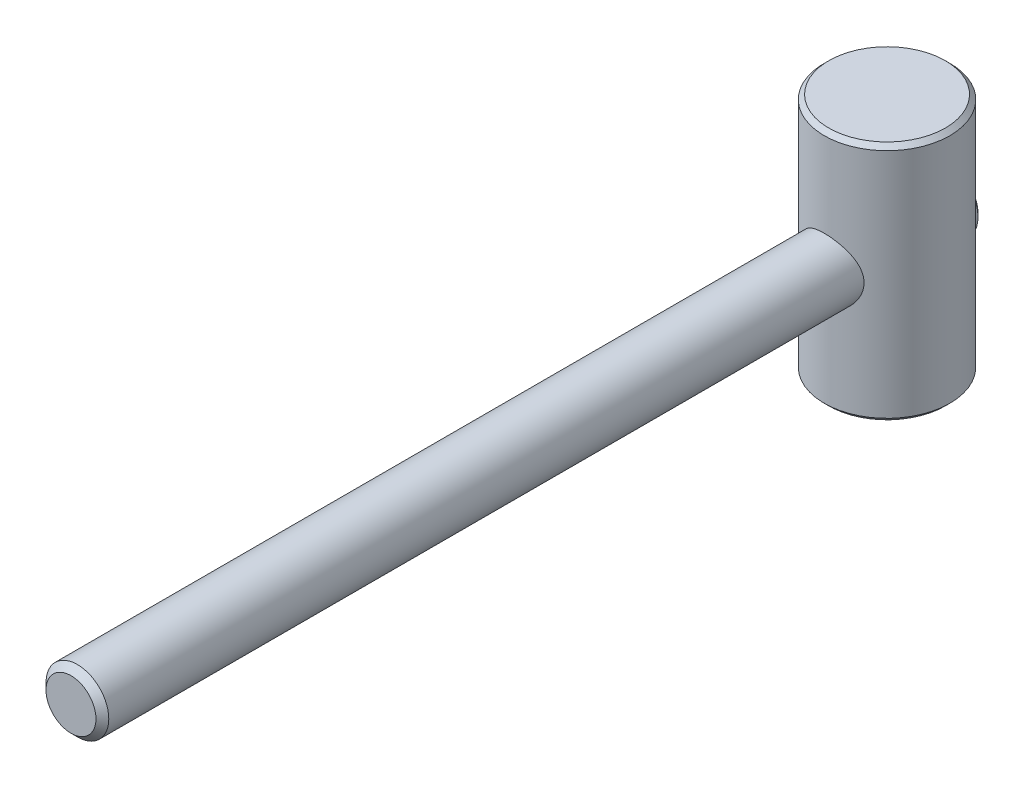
ISO-10303-21;
HEADER;
FILE_DESCRIPTION(('STEP AP214'),'2;1');
FILE_NAME('part.step','',(''),(''),'','','');
FILE_SCHEMA(('AUTOMOTIVE_DESIGN { 1 0 10303 214 1 1 1 1 }'));
ENDSEC;
DATA;
#1=APPLICATION_CONTEXT('core data for automotive mechanical design processes');
#2=APPLICATION_PROTOCOL_DEFINITION('international standard','automotive_design',2000,#1);
#3=PRODUCT_CONTEXT('',#1,'mechanical');
#4=PRODUCT('Part','Part','',(#3));
#5=PRODUCT_RELATED_PRODUCT_CATEGORY('part','',(#4));
#6=PRODUCT_DEFINITION_FORMATION('','',#4);
#7=PRODUCT_DEFINITION_CONTEXT('part definition',#1,'design');
#8=PRODUCT_DEFINITION('design','',#6,#7);
#9=PRODUCT_DEFINITION_SHAPE('','',#8);
#10=(LENGTH_UNIT() NAMED_UNIT(*) SI_UNIT(.MILLI.,.METRE.));
#11=(NAMED_UNIT(*) PLANE_ANGLE_UNIT() SI_UNIT($,.RADIAN.));
#12=(NAMED_UNIT(*) SI_UNIT($,.STERADIAN.) SOLID_ANGLE_UNIT());
#13=UNCERTAINTY_MEASURE_WITH_UNIT(LENGTH_MEASURE(1.E-05),#10,'distance_accuracy_value','');
#14=(GEOMETRIC_REPRESENTATION_CONTEXT(3) GLOBAL_UNCERTAINTY_ASSIGNED_CONTEXT((#13)) GLOBAL_UNIT_ASSIGNED_CONTEXT((#10,
#11,#12)) REPRESENTATION_CONTEXT('',''));
#15=CARTESIAN_POINT('',(0.,0.,0.));
#16=DIRECTION('',(0.,0.,1.));
#17=DIRECTION('',(1.,0.,0.));
#18=AXIS2_PLACEMENT_3D('',#15,#16,#17);
#19=CARTESIAN_POINT('',(0.,0.,-5.));
#20=DIRECTION('',(0.,0.,1.));
#21=DIRECTION('',(1.,0.,0.));
#22=AXIS2_PLACEMENT_3D('',#19,#20,#21);
#23=CYLINDRICAL_SURFACE('',#22,1.5);
#24=CARTESIAN_POINT('',(-0.947331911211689,1.16299709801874,-11.8465));
#25=CARTESIAN_POINT('',(-1.01351143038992,1.10908406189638,-11.8245053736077));
#26=CARTESIAN_POINT('',(-1.07489527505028,1.04969000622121,-11.801479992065));
#27=CARTESIAN_POINT('',(-1.18710041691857,0.920938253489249,-11.7558012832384));
#28=CARTESIAN_POINT('',(-1.2378650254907,0.851530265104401,-11.7331505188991));
#29=CARTESIAN_POINT('',(-1.32722551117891,0.704204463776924,-11.6908987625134));
#30=CARTESIAN_POINT('',(-1.36579908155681,0.626271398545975,-11.6713033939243));
#31=CARTESIAN_POINT('',(-1.42909401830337,0.46394540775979,-11.6379877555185));
#32=CARTESIAN_POINT('',(-1.45385048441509,0.379569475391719,-11.6242526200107));
#33=CARTESIAN_POINT('',(-1.48697739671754,0.213368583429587,-11.6056166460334));
#34=CARTESIAN_POINT('',(-1.49644089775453,0.131829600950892,-11.6001287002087));
#35=CARTESIAN_POINT('',(-1.5018928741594,-0.0318566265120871,-11.5969853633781));
#36=CARTESIAN_POINT('',(-1.49788424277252,-0.114003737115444,-11.5993282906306));
#37=CARTESIAN_POINT('',(-1.47773438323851,-0.267779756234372,-11.6108251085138));
#38=CARTESIAN_POINT('',(-1.4628558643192,-0.339634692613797,-11.6192692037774));
#39=CARTESIAN_POINT('',(-1.42308110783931,-0.479735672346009,-11.6410889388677));
#40=CARTESIAN_POINT('',(-1.39818007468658,-0.547979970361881,-11.6544669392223));
#41=CARTESIAN_POINT('',(-1.33746138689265,-0.683395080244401,-11.6855957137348));
#42=CARTESIAN_POINT('',(-1.30108662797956,-0.750265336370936,-11.7035578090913));
#43=CARTESIAN_POINT('',(-1.21901847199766,-0.877331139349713,-11.7415381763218));
#44=CARTESIAN_POINT('',(-1.17332890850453,-0.93752941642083,-11.7615556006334));
#45=CARTESIAN_POINT('',(-1.09644538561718,-1.02443697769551,-11.7926076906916));
#46=CARTESIAN_POINT('',(-1.06820925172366,-1.05384666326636,-11.8035531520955));
#47=CARTESIAN_POINT('',(-1.00945808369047,-1.11024632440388,-11.825238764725));
#48=CARTESIAN_POINT('',(-0.978947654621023,-1.13724095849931,-11.8359792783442));
#49=CARTESIAN_POINT('',(-0.947331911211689,-1.16299709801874,-11.8465));
#50=B_SPLINE_CURVE_WITH_KNOTS('',3,(#24,#25,#26,#27,#28,#29,#30,#31,#32,#33,#34,#35,#36,#37,#38,
#39,#40,#41,#42,#43,#44,#45,#46,#47,#48,#49),.UNSPECIFIED.,.F.,.F.,(4,2,2,2,2,2,2,2,2,2,2,2,4),
(0.,0.264174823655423,0.52972579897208,0.795759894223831,1.06111506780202,1.30649824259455,
1.55182872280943,1.77244859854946,1.99317416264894,2.22691434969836,2.46055853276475,
2.58708455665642,2.71336100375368),.UNSPECIFIED.);
#51=CARTESIAN_POINT('',(-0.947331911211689,1.16299709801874,-11.8465));
#52=VERTEX_POINT('',#51);
#53=CARTESIAN_POINT('',(-0.947331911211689,-1.16299709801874,-11.8465));
#54=VERTEX_POINT('',#53);
#55=EDGE_CURVE('E271',#52,#54,#50,.T.);
#56=ORIENTED_EDGE('',*,*,#55,.F.);
#57=CARTESIAN_POINT('',(0.,0.,-11.8465));
#58=DIRECTION('',(0.,0.,1.));
#59=DIRECTION('',(1.,0.,0.));
#60=AXIS2_PLACEMENT_3D('',#57,#58,#59);
#61=CIRCLE('',#60,1.5);
#62=EDGE_CURVE('E308',#52,#54,#61,.T.);
#63=ORIENTED_EDGE('',*,*,#62,.T.);
#64=EDGE_LOOP('',(#56,#63));
#65=FACE_BOUND('',#64,.T.);
#66=ADVANCED_FACE('F14',(#65),#23,.T.);
#67=CARTESIAN_POINT('',(0.,0.,-12.));
#68=DIRECTION('',(0.,0.,1.));
#69=DIRECTION('',(1.,0.,0.));
#70=AXIS2_PLACEMENT_3D('',#67,#68,#69);
#71=PLANE('',#70);
#72=DIRECTION('',(0.,-1.,0.));
#73=VECTOR('',#72,1.);
#74=CARTESIAN_POINT('',(0.3,0.,-12.));
#75=LINE('',#74,#73);
#76=CARTESIAN_POINT('',(0.3,1.31265465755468,-12.));
#77=VERTEX_POINT('',#76);
#78=CARTESIAN_POINT('',(0.3,-1.31265465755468,-12.));
#79=VERTEX_POINT('',#78);
#80=EDGE_CURVE('E36',#77,#79,#75,.T.);
#81=ORIENTED_EDGE('',*,*,#80,.F.);
#82=CARTESIAN_POINT('',(0.,0.,-12.));
#83=DIRECTION('',(0.,0.,1.));
#84=DIRECTION('',(1.,0.,0.));
#85=AXIS2_PLACEMENT_3D('',#82,#83,#84);
#86=CIRCLE('',#85,1.3465);
#87=EDGE_CURVE('E305',#79,#77,#86,.T.);
#88=ORIENTED_EDGE('',*,*,#87,.F.);
#89=EDGE_LOOP('',(#81,#88));
#90=FACE_BOUND('',#89,.T.);
#91=ADVANCED_FACE('F231',(#90),#71,.F.);
#92=CARTESIAN_POINT('',(0.,0.,-12.));
#93=DIRECTION('',(0.,0.,1.));
#94=DIRECTION('',(1.,0.,0.));
#95=AXIS2_PLACEMENT_3D('',#92,#93,#94);
#96=CONICAL_SURFACE('',#95,1.3465,0.785398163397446);
#97=CARTESIAN_POINT('',(0.992835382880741,1.14506318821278,-11.83095));
#98=CARTESIAN_POINT('',(0.929590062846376,1.17057691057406,-11.8531359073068));
#99=CARTESIAN_POINT('',(0.864893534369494,1.19430901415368,-11.8734384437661));
#100=CARTESIAN_POINT('',(0.733580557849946,1.23716783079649,-11.9097164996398));
#101=CARTESIAN_POINT('',(0.666989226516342,1.25633751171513,-11.9257325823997));
#102=CARTESIAN_POINT('',(0.531496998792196,1.28959120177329,-11.9533515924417));
#103=CARTESIAN_POINT('',(0.462592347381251,1.30366645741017,-11.9649469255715));
#104=CARTESIAN_POINT('',(0.322550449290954,1.32622709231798,-11.9834605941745));
#105=CARTESIAN_POINT('',(0.251397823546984,1.33465555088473,-11.9903313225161));
#106=CARTESIAN_POINT('',(0.1798,1.33988292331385,-11.994607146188));
#107=B_SPLINE_CURVE_WITH_KNOTS('',3,(#97,#98,#99,#100,#101,#102,#103,#104,#105,#106),
.UNSPECIFIED.,.F.,.F.,(4,2,2,2,4),(0.,0.215180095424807,0.428245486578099,0.641675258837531,
0.857225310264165),.UNSPECIFIED.);
#108=CARTESIAN_POINT('',(0.947331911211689,1.16299709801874,-11.8465));
#109=VERTEX_POINT('',#108);
#110=CARTESIAN_POINT('',(0.674247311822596,1.25340780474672,-11.92325));
#111=VERTEX_POINT('',#110);
#112=EDGE_CURVE('E108',#109,#111,#107,.T.);
#113=ORIENTED_EDGE('',*,*,#112,.F.);
#114=CARTESIAN_POINT('',(0.947331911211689,-1.16299709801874,-11.8465));
#115=VERTEX_POINT('',#114);
#116=EDGE_CURVE('E309',#115,#109,#61,.T.);
#117=ORIENTED_EDGE('',*,*,#116,.F.);
#118=CARTESIAN_POINT('',(0.1798,-1.33988292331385,-11.994607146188));
#119=CARTESIAN_POINT('',(0.236038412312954,-1.335761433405,-11.9912402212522));
#120=CARTESIAN_POINT('',(0.292017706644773,-1.3296804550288,-11.9862800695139));
#121=CARTESIAN_POINT('',(0.40306300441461,-1.31386344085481,-11.9733225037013));
#122=CARTESIAN_POINT('',(0.458129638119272,-1.30413004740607,-11.9653272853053));
#123=CARTESIAN_POINT('',(0.566267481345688,-1.28142693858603,-11.9465768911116));
#124=CARTESIAN_POINT('',(0.619355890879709,-1.26850488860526,-11.9358623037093));
#125=CARTESIAN_POINT('',(0.724099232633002,-1.23969917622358,-11.9117977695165));
#126=CARTESIAN_POINT('',(0.775754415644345,-1.22381603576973,-11.8984482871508));
#127=CARTESIAN_POINT('',(0.854754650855,-1.1971455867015,-11.8758046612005));
#128=CARTESIAN_POINT('',(0.882653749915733,-1.18725045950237,-11.8673620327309));
#129=CARTESIAN_POINT('',(0.938066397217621,-1.16670181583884,-11.8497157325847));
#130=CARTESIAN_POINT('',(0.965577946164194,-1.15604541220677,-11.8405091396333));
#131=CARTESIAN_POINT('',(0.992835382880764,-1.14506318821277,-11.83095));
#132=B_SPLINE_CURVE_WITH_KNOTS('',3,(#118,#119,#120,#121,#122,#123,#124,#125,#126,#127,#128,
#129,#130,#131),.UNSPECIFIED.,.F.,.F.,(4,2,2,2,2,2,4),(0.,0.169384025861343,0.338645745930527,
0.505516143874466,0.672357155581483,0.764685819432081,0.857385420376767),.UNSPECIFIED.);
#133=CARTESIAN_POINT('',(0.674247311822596,-1.25340780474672,-11.92325));
#134=VERTEX_POINT('',#133);
#135=EDGE_CURVE('E114',#134,#115,#132,.T.);
#136=ORIENTED_EDGE('',*,*,#135,.F.);
#137=CARTESIAN_POINT('',(0.,0.,-11.92325));
#138=DIRECTION('',(0.,0.,-1.));
#139=DIRECTION('',(-1.,0.,0.));
#140=AXIS2_PLACEMENT_3D('',#137,#138,#139);
#141=CIRCLE('',#140,1.42325);
#142=CARTESIAN_POINT('',(0.3,-1.39127300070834,-11.92325));
#143=VERTEX_POINT('',#142);
#144=EDGE_CURVE('E194',#134,#143,#141,.T.);
#145=ORIENTED_EDGE('',*,*,#144,.T.);
#146=CARTESIAN_POINT('',(0.3,1.4704082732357,-11.8458));
#147=CARTESIAN_POINT('',(0.3,1.43432199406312,-11.881156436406));
#148=CARTESIAN_POINT('',(0.3,1.39821111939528,-11.9164877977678));
#149=CARTESIAN_POINT('',(0.3,1.32586601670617,-11.9871401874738));
#150=CARTESIAN_POINT('',(0.3,1.28963168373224,-12.0224611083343));
#151=CARTESIAN_POINT('',(0.3,1.21609681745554,-12.0939762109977));
#152=CARTESIAN_POINT('',(0.3,1.17879403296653,-12.1301680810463));
#153=CARTESIAN_POINT('',(0.3,1.10413383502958,-12.2023744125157));
#154=CARTESIAN_POINT('',(0.3,1.06677660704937,-12.2383890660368));
#155=CARTESIAN_POINT('',(0.3,0.959421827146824,-12.3414650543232));
#156=CARTESIAN_POINT('',(0.3,0.88924153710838,-12.4083374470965));
#157=CARTESIAN_POINT('',(0.3,0.782999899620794,-12.5080826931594));
#158=CARTESIAN_POINT('',(0.3,0.7473051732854,-12.5413456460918));
#159=CARTESIAN_POINT('',(0.3,0.67557200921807,-12.6074459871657));
#160=CARTESIAN_POINT('',(0.3,0.639533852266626,-12.6402836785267));
#161=CARTESIAN_POINT('',(0.3,0.567825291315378,-12.7044893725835));
#162=CARTESIAN_POINT('',(0.3,0.532169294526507,-12.7358734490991));
#163=CARTESIAN_POINT('',(0.3,0.459887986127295,-12.7977398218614));
#164=CARTESIAN_POINT('',(0.3,0.423260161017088,-12.8282192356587));
#165=CARTESIAN_POINT('',(0.3,0.367400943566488,-12.8723076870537));
#166=CARTESIAN_POINT('',(0.3,0.348748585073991,-12.8866467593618));
#167=CARTESIAN_POINT('',(0.3,0.310930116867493,-12.9146268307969));
#168=CARTESIAN_POINT('',(0.3,0.291764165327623,-12.9282680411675));
#169=CARTESIAN_POINT('',(0.3,0.252814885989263,-12.9544441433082));
#170=CARTESIAN_POINT('',(0.3,0.233034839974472,-12.9669838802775));
#171=CARTESIAN_POINT('',(0.3,0.192530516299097,-12.990417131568));
#172=CARTESIAN_POINT('',(0.3,0.171808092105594,-13.0013137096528));
#173=CARTESIAN_POINT('',(0.3,0.145940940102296,-13.0129096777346));
#174=CARTESIAN_POINT('',(0.3,0.141366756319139,-13.0148871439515));
#175=CARTESIAN_POINT('',(0.3,0.132159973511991,-13.0187064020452));
#176=CARTESIAN_POINT('',(0.3,0.127527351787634,-13.0205481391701));
#177=CARTESIAN_POINT('',(0.3,0.113544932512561,-13.0258474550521));
#178=CARTESIAN_POINT('',(0.3,0.104108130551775,-13.0290802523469));
#179=CARTESIAN_POINT('',(0.3,0.0851689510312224,-13.0347728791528));
#180=CARTESIAN_POINT('',(0.3,0.0756701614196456,-13.0372444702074));
#181=CARTESIAN_POINT('',(0.3,0.0564948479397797,-13.0413716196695));
#182=CARTESIAN_POINT('',(0.3,0.0468182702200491,-13.0430269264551));
#183=CARTESIAN_POINT('',(0.3,0.0172377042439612,-13.0466422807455));
#184=CARTESIAN_POINT('',(0.3,-0.00287379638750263,-13.047140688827));
#185=CARTESIAN_POINT('',(0.3,-0.0428030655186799,-13.0441231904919));
#186=CARTESIAN_POINT('',(0.3,-0.0626200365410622,-13.0405978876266));
#187=CARTESIAN_POINT('',(0.3,-0.108260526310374,-13.0285808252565));
#188=CARTESIAN_POINT('',(0.3,-0.133719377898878,-13.0187703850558));
#189=CARTESIAN_POINT('',(0.3,-0.17070809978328,-13.0015048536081));
#190=CARTESIAN_POINT('',(0.3,-0.182880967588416,-12.9952966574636));
#191=CARTESIAN_POINT('',(0.3,-0.206871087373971,-12.9822268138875));
#192=CARTESIAN_POINT('',(0.3,-0.218688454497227,-12.9753653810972));
#193=CARTESIAN_POINT('',(0.3,-0.256757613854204,-12.9521887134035));
#194=CARTESIAN_POINT('',(0.3,-0.282394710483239,-12.9348757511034));
#195=CARTESIAN_POINT('',(0.3,-0.332686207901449,-12.8988661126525));
#196=CARTESIAN_POINT('',(0.3,-0.357339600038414,-12.8801680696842));
#197=CARTESIAN_POINT('',(0.3,-0.406041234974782,-12.8418786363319));
#198=CARTESIAN_POINT('',(0.3,-0.43008777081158,-12.8222850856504));
#199=CARTESIAN_POINT('',(0.3,-0.477720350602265,-12.7825441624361));
#200=CARTESIAN_POINT('',(0.3,-0.501306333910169,-12.762396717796));
#201=CARTESIAN_POINT('',(0.3,-0.571740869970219,-12.7012598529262));
#202=CARTESIAN_POINT('',(0.3,-0.618101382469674,-12.6597098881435));
#203=CARTESIAN_POINT('',(0.3,-0.710039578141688,-12.5759094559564));
#204=CARTESIAN_POINT('',(0.3,-0.755618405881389,-12.5336602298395));
#205=CARTESIAN_POINT('',(0.3,-0.857897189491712,-12.4378825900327));
#206=CARTESIAN_POINT('',(0.3,-0.914473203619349,-12.3842219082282));
#207=CARTESIAN_POINT('',(0.3,-1.02726219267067,-12.2764551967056));
#208=CARTESIAN_POINT('',(0.3,-1.08347493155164,-12.2223489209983));
#209=CARTESIAN_POINT('',(0.3,-1.19491746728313,-12.1145797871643));
#210=CARTESIAN_POINT('',(0.3,-1.25015053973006,-12.0609203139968));
#211=CARTESIAN_POINT('',(0.3,-1.36040840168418,-11.9534572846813));
#212=CARTESIAN_POINT('',(0.3,-1.41543330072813,-11.8996538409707));
#213=CARTESIAN_POINT('',(0.3,-1.4704082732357,-11.8458));
#214=B_SPLINE_CURVE_WITH_KNOTS('',3,(#146,#147,#148,#149,#150,#151,#152,#153,#154,#155,#156,
#157,#158,#159,#160,#161,#162,#163,#164,#165,#166,#167,#168,#169,#170,#171,#172,#173,#174,#175,
#176,#177,#178,#179,#180,#181,#182,#183,#184,#185,#186,#187,#188,#189,#190,#191,#192,#193,#194,
#195,#196,#197,#198,#199,#200,#201,#202,#203,#204,#205,#206,#207,#208,#209,#210,#211,#212,#213),
.UNSPECIFIED.,.F.,.F.,(4,2,2,2,2,2,2,2,2,2,2,2,2,2,2,2,2,2,2,2,2,2,2,2,2,2,2,2,2,2,2,2,2,4),(0.,
0.151560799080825,0.303364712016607,0.459287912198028,0.614959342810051,0.905769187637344,
1.05213984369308,1.1983996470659,1.34089509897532,1.48380422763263,1.55437528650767,
1.62492485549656,1.69514667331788,1.76523589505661,1.78018397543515,1.79513805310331,
1.82503814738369,1.85444992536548,1.88387076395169,1.94377833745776,2.00382609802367,
2.08518752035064,2.12617578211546,2.16715062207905,2.25986253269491,2.35266718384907,
2.44570893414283,2.53876285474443,2.72550711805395,2.91194943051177,3.14587396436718,
3.37993768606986,3.6109572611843,3.84183089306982),.UNSPECIFIED.);
#215=EDGE_CURVE('E227',#79,#143,#214,.T.);
#216=ORIENTED_EDGE('',*,*,#215,.F.);
#217=ORIENTED_EDGE('',*,*,#87,.T.);
#218=CARTESIAN_POINT('',(0.3,1.39127300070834,-11.92325));
#219=VERTEX_POINT('',#218);
#220=EDGE_CURVE('E32',#219,#77,#214,.T.);
#221=ORIENTED_EDGE('',*,*,#220,.F.);
#222=CARTESIAN_POINT('',(0.,0.,-11.92325));
#223=DIRECTION('',(0.,0.,-1.));
#224=DIRECTION('',(-1.,0.,0.));
#225=AXIS2_PLACEMENT_3D('',#222,#223,#224);
#226=CIRCLE('',#225,1.42325);
#227=EDGE_CURVE('E104',#219,#111,#226,.T.);
#228=ORIENTED_EDGE('',*,*,#227,.T.);
#229=EDGE_LOOP('',(#113,#117,#136,#145,#216,#217,#221,#228));
#230=FACE_BOUND('',#229,.T.);
#231=ADVANCED_FACE('F106',(#230),#96,.T.);
#232=CARTESIAN_POINT('',(-0.3,0.,-42.3));
#233=DIRECTION('',(1.,0.,0.));
#234=DIRECTION('',(0.,-1.,0.));
#235=AXIS2_PLACEMENT_3D('',#232,#233,#234);
#236=CYLINDRICAL_SURFACE('',#235,31.5);
#237=CARTESIAN_POINT('',(-0.3,-1.33111241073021,-10.8281373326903));
#238=CARTESIAN_POINT('',(-0.262266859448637,-1.33962103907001,-10.8284977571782));
#239=CARTESIAN_POINT('',(-0.224170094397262,-1.34651682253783,-10.828792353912));
#240=CARTESIAN_POINT('',(-0.14752354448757,-1.35705208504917,-10.8292445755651));
#241=CARTESIAN_POINT('',(-0.108973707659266,-1.36069118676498,-10.8294021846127));
#242=CARTESIAN_POINT('',(-0.0324105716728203,-1.36464401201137,-10.8295734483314));
#243=CARTESIAN_POINT('',(0.00559964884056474,-1.3650173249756,-10.8295896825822));
#244=CARTESIAN_POINT('',(0.0815076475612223,-1.36259212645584,-10.8294844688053));
#245=CARTESIAN_POINT('',(0.119405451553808,-1.35979440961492,-10.8293630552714));
#246=CARTESIAN_POINT('',(0.205128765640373,-1.34986012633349,-10.8289356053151));
#247=CARTESIAN_POINT('',(0.252842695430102,-1.34174825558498,-10.8285882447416));
#248=CARTESIAN_POINT('',(0.3,-1.33111241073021,-10.8281373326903));
#249=B_SPLINE_CURVE_WITH_KNOTS('',3,(#237,#238,#239,#240,#241,#242,#243,#244,#245,#246,#247,
#248),.UNSPECIFIED.,.F.,.F.,(4,2,2,2,2,4),(0.,0.116010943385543,0.232035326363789,
0.345938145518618,0.459812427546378,0.604746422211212),.UNSPECIFIED.);
#250=CARTESIAN_POINT('',(-0.3,-1.33111241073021,-10.8281373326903));
#251=VERTEX_POINT('',#250);
#252=CARTESIAN_POINT('',(0.3,-1.33111241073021,-10.8281373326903));
#253=VERTEX_POINT('',#252);
#254=EDGE_CURVE('E199',#251,#253,#249,.T.);
#255=ORIENTED_EDGE('',*,*,#254,.F.);
#256=CARTESIAN_POINT('',(-0.3,0.,-42.3));
#257=DIRECTION('',(-1.,0.,0.));
#258=DIRECTION('',(0.,1.,0.));
#259=AXIS2_PLACEMENT_3D('',#256,#257,#258);
#260=CIRCLE('',#259,31.5);
#261=CARTESIAN_POINT('',(-0.3,1.33111241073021,-10.8281373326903));
#262=VERTEX_POINT('',#261);
#263=EDGE_CURVE('E19',#251,#262,#260,.T.);
#264=ORIENTED_EDGE('',*,*,#263,.T.);
#265=CARTESIAN_POINT('',(0.3,1.33111241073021,-10.8281373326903));
#266=CARTESIAN_POINT('',(0.262266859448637,1.33962103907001,-10.8284977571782));
#267=CARTESIAN_POINT('',(0.224170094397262,1.34651682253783,-10.828792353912));
#268=CARTESIAN_POINT('',(0.14752354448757,1.35705208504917,-10.8292445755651));
#269=CARTESIAN_POINT('',(0.108973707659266,1.36069118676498,-10.8294021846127));
#270=CARTESIAN_POINT('',(0.0324105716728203,1.36464401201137,-10.8295734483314));
#271=CARTESIAN_POINT('',(-0.00559964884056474,1.3650173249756,-10.8295896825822));
#272=CARTESIAN_POINT('',(-0.0815076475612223,1.36259212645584,-10.8294844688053));
#273=CARTESIAN_POINT('',(-0.119405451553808,1.35979440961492,-10.8293630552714));
#274=CARTESIAN_POINT('',(-0.205128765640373,1.34986012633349,-10.8289356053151));
#275=CARTESIAN_POINT('',(-0.252842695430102,1.34174825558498,-10.8285882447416));
#276=CARTESIAN_POINT('',(-0.3,1.33111241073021,-10.8281373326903));
#277=B_SPLINE_CURVE_WITH_KNOTS('',3,(#265,#266,#267,#268,#269,#270,#271,#272,#273,#274,#275,
#276),.UNSPECIFIED.,.F.,.F.,(4,2,2,2,2,4),(0.,0.116010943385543,0.232035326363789,
0.345938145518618,0.459812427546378,0.604746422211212),.UNSPECIFIED.);
#278=CARTESIAN_POINT('',(0.3,1.33111241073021,-10.8281373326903));
#279=VERTEX_POINT('',#278);
#280=EDGE_CURVE('E143',#279,#262,#277,.T.);
#281=ORIENTED_EDGE('',*,*,#280,.F.);
#282=CARTESIAN_POINT('',(0.3,0.,-42.3));
#283=DIRECTION('',(-1.,0.,0.));
#284=DIRECTION('',(0.,1.,0.));
#285=AXIS2_PLACEMENT_3D('',#282,#283,#284);
#286=CIRCLE('',#285,31.5);
#287=EDGE_CURVE('E130',#253,#279,#286,.T.);
#288=ORIENTED_EDGE('',*,*,#287,.F.);
#289=EDGE_LOOP('',(#255,#264,#281,#288));
#290=FACE_BOUND('',#289,.T.);
#291=ADVANCED_FACE('F206',(#290),#236,.F.);
#292=CARTESIAN_POINT('',(0.3,0.,-42.3));
#293=DIRECTION('',(-1.,0.,0.));
#294=DIRECTION('',(0.,1.,0.));
#295=AXIS2_PLACEMENT_3D('',#292,#293,#294);
#296=PLANE('',#295);
#297=CARTESIAN_POINT('',(0.3,-0.671318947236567,-11.2353020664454));
#298=CARTESIAN_POINT('',(0.3,-0.697833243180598,-11.2595157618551));
#299=CARTESIAN_POINT('',(0.3,-0.724235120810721,-11.283851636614));
#300=CARTESIAN_POINT('',(0.3,-0.776860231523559,-11.3327148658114));
#301=CARTESIAN_POINT('',(0.3,-0.803083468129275,-11.3572422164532));
#302=CARTESIAN_POINT('',(0.3,-0.881553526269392,-11.4310312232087));
#303=CARTESIAN_POINT('',(0.3,-0.933603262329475,-11.4805021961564));
#304=CARTESIAN_POINT('',(0.3,-1.03737516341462,-11.5797783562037));
#305=CARTESIAN_POINT('',(0.3,-1.08909735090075,-11.6295835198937));
#306=CARTESIAN_POINT('',(0.3,-1.19232568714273,-11.7294186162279));
#307=CARTESIAN_POINT('',(0.3,-1.24383183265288,-11.7794485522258));
#308=CARTESIAN_POINT('',(0.3,-1.41719880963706,-11.9483370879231));
#309=CARTESIAN_POINT('',(0.3,-1.53872304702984,-12.0675409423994));
#310=CARTESIAN_POINT('',(0.3,-1.72072148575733,-12.2466471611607));
#311=CARTESIAN_POINT('',(0.3,-1.78134186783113,-12.3064015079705));
#312=CARTESIAN_POINT('',(0.3,-1.9025053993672,-12.4259878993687));
#313=CARTESIAN_POINT('',(0.3,-1.96304854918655,-12.4858199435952));
#314=CARTESIAN_POINT('',(0.3,-2.02356348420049,-12.545680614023));
#315=B_SPLINE_CURVE_WITH_KNOTS('',3,(#297,#298,#299,#300,#301,#302,#303,#304,#305,#306,#307,
#308,#309,#310,#311,#312,#313,#314),.UNSPECIFIED.,.F.,.F.,(4,2,2,2,2,2,2,2,4),(0.,
0.107719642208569,0.215437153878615,0.430861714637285,0.646271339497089,0.861684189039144,
1.37236666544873,1.62772666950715,1.88308548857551),.UNSPECIFIED.);
#316=CARTESIAN_POINT('',(0.3,-1.33111241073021,-11.8645));
#317=VERTEX_POINT('',#316);
#318=EDGE_CURVE('E178',#317,#143,#315,.T.);
#319=ORIENTED_EDGE('',*,*,#318,.F.);
#320=DIRECTION('',(0.,0.,1.));
#321=VECTOR('',#320,1.);
#322=CARTESIAN_POINT('',(0.3,-1.33111241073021,-6.));
#323=LINE('',#322,#321);
#324=EDGE_CURVE('E292',#253,#317,#323,.F.);
#325=ORIENTED_EDGE('',*,*,#324,.F.);
#326=ORIENTED_EDGE('',*,*,#287,.T.);
#327=DIRECTION('',(0.,0.,1.));
#328=VECTOR('',#327,1.);
#329=CARTESIAN_POINT('',(0.3,1.33111241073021,-6.));
#330=LINE('',#329,#328);
#331=CARTESIAN_POINT('',(0.3,1.33111241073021,-11.8645));
#332=VERTEX_POINT('',#331);
#333=EDGE_CURVE('E299',#332,#279,#330,.T.);
#334=ORIENTED_EDGE('',*,*,#333,.F.);
#335=CARTESIAN_POINT('',(0.3,2.02134819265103,-12.5434892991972));
#336=CARTESIAN_POINT('',(0.3,1.96583089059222,-12.4885737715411));
#337=CARTESIAN_POINT('',(0.3,1.91028984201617,-12.4336823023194));
#338=CARTESIAN_POINT('',(0.3,1.79914422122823,-12.3239633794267));
#339=CARTESIAN_POINT('',(0.3,1.74353964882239,-12.2691359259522));
#340=CARTESIAN_POINT('',(0.3,1.57661382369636,-12.1047805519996));
#341=CARTESIAN_POINT('',(0.3,1.46517376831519,-11.9953729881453));
#342=CARTESIAN_POINT('',(0.3,1.29755058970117,-11.8317264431));
#343=CARTESIAN_POINT('',(0.3,1.24159669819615,-11.7772528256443));
#344=CARTESIAN_POINT('',(0.3,1.12946087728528,-11.668542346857));
#345=CARTESIAN_POINT('',(0.3,1.07327895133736,-11.614305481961));
#346=CARTESIAN_POINT('',(0.3,0.960561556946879,-11.5061914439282));
#347=CARTESIAN_POINT('',(0.3,0.904026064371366,-11.4523142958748));
#348=CARTESIAN_POINT('',(0.3,0.81878330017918,-11.3719612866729));
#349=CARTESIAN_POINT('',(0.3,0.790295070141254,-11.3452534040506));
#350=CARTESIAN_POINT('',(0.3,0.733115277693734,-11.2920550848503));
#351=CARTESIAN_POINT('',(0.3,0.704423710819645,-11.2655646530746));
#352=CARTESIAN_POINT('',(0.3,0.675602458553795,-11.2392149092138));
#353=B_SPLINE_CURVE_WITH_KNOTS('',3,(#335,#336,#337,#338,#339,#340,#341,#342,#343,#344,#345,
#346,#347,#348,#349,#350,#351,#352),.UNSPECIFIED.,.F.,.F.,(4,2,2,2,2,2,2,2,4),(0.,
0.234266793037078,0.468534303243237,0.937041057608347,1.1713137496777,1.40558290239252,
1.63986822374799,1.75701676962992,1.87416789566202),.UNSPECIFIED.);
#354=EDGE_CURVE('E170',#219,#332,#353,.T.);
#355=ORIENTED_EDGE('',*,*,#354,.F.);
#356=ORIENTED_EDGE('',*,*,#220,.T.);
#357=ORIENTED_EDGE('',*,*,#80,.T.);
#358=ORIENTED_EDGE('',*,*,#215,.T.);
#359=EDGE_LOOP('',(#319,#325,#326,#334,#355,#356,#357,#358));
#360=FACE_BOUND('',#359,.T.);
#361=ADVANCED_FACE('F210',(#360),#296,.T.);
#362=CARTESIAN_POINT('',(-0.3,1.31265465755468,-12.));
#363=VERTEX_POINT('',#362);
#364=CARTESIAN_POINT('',(-0.3,-1.31265465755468,-12.));
#365=VERTEX_POINT('',#364);
#366=EDGE_CURVE('E301',#363,#365,#86,.T.);
#367=ORIENTED_EDGE('',*,*,#366,.F.);
#368=DIRECTION('',(0.,-1.,0.));
#369=VECTOR('',#368,1.);
#370=CARTESIAN_POINT('',(-0.3,0.,-12.));
#371=LINE('',#370,#369);
#372=EDGE_CURVE('E311',#363,#365,#371,.T.);
#373=ORIENTED_EDGE('',*,*,#372,.T.);
#374=EDGE_LOOP('',(#367,#373));
#375=FACE_BOUND('',#374,.T.);
#376=ADVANCED_FACE('F218',(#375),#71,.F.);
#377=CARTESIAN_POINT('',(-0.1798,1.33988292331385,-11.994607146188));
#378=CARTESIAN_POINT('',(-0.236038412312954,1.335761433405,-11.9912402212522));
#379=CARTESIAN_POINT('',(-0.292017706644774,1.3296804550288,-11.9862800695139));
#380=CARTESIAN_POINT('',(-0.403063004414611,1.31386344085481,-11.9733225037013));
#381=CARTESIAN_POINT('',(-0.458129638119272,1.30413004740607,-11.9653272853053));
#382=CARTESIAN_POINT('',(-0.566267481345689,1.28142693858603,-11.9465768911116));
#383=CARTESIAN_POINT('',(-0.61935589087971,1.26850488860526,-11.9358623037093));
#384=CARTESIAN_POINT('',(-0.724099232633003,1.23969917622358,-11.9117977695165));
#385=CARTESIAN_POINT('',(-0.775754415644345,1.22381603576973,-11.8984482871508));
#386=CARTESIAN_POINT('',(-0.854754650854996,1.1971455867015,-11.8758046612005));
#387=CARTESIAN_POINT('',(-0.882653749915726,1.18725045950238,-11.8673620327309));
#388=CARTESIAN_POINT('',(-0.938066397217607,1.16670181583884,-11.8497157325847));
#389=CARTESIAN_POINT('',(-0.965577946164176,1.15604541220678,-11.8405091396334));
#390=CARTESIAN_POINT('',(-0.992835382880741,1.14506318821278,-11.83095));
#391=B_SPLINE_CURVE_WITH_KNOTS('',3,(#377,#378,#379,#380,#381,#382,#383,#384,#385,#386,#387,
#388,#389,#390),.UNSPECIFIED.,.F.,.F.,(4,2,2,2,2,2,4),(0.,0.169384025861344,0.338645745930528,
0.505516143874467,0.672357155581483,0.764685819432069,0.857385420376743),.UNSPECIFIED.);
#392=CARTESIAN_POINT('',(-0.674247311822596,1.25340780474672,-11.92325));
#393=VERTEX_POINT('',#392);
#394=EDGE_CURVE('E250',#393,#52,#391,.T.);
#395=ORIENTED_EDGE('',*,*,#394,.F.);
#396=CARTESIAN_POINT('',(0.,0.,-11.92325));
#397=DIRECTION('',(0.,0.,-1.));
#398=DIRECTION('',(-1.,0.,0.));
#399=AXIS2_PLACEMENT_3D('',#396,#397,#398);
#400=CIRCLE('',#399,1.42325);
#401=CARTESIAN_POINT('',(-0.3,1.39127300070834,-11.92325));
#402=VERTEX_POINT('',#401);
#403=EDGE_CURVE('E128',#393,#402,#400,.T.);
#404=ORIENTED_EDGE('',*,*,#403,.T.);
#405=CARTESIAN_POINT('',(-0.3,1.4704082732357,-11.8458));
#406=CARTESIAN_POINT('',(-0.3,1.43432199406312,-11.881156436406));
#407=CARTESIAN_POINT('',(-0.3,1.39821111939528,-11.9164877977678));
#408=CARTESIAN_POINT('',(-0.3,1.32586601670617,-11.9871401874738));
#409=CARTESIAN_POINT('',(-0.3,1.28963168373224,-12.0224611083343));
#410=CARTESIAN_POINT('',(-0.3,1.21609681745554,-12.0939762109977));
#411=CARTESIAN_POINT('',(-0.3,1.17879403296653,-12.1301680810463));
#412=CARTESIAN_POINT('',(-0.3,1.10413383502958,-12.2023744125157));
#413=CARTESIAN_POINT('',(-0.3,1.06677660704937,-12.2383890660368));
#414=CARTESIAN_POINT('',(-0.3,0.959421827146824,-12.3414650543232));
#415=CARTESIAN_POINT('',(-0.3,0.88924153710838,-12.4083374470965));
#416=CARTESIAN_POINT('',(-0.3,0.782999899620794,-12.5080826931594));
#417=CARTESIAN_POINT('',(-0.3,0.7473051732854,-12.5413456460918));
#418=CARTESIAN_POINT('',(-0.3,0.67557200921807,-12.6074459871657));
#419=CARTESIAN_POINT('',(-0.3,0.639533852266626,-12.6402836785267));
#420=CARTESIAN_POINT('',(-0.3,0.567825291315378,-12.7044893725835));
#421=CARTESIAN_POINT('',(-0.3,0.532169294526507,-12.7358734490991));
#422=CARTESIAN_POINT('',(-0.3,0.459887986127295,-12.7977398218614));
#423=CARTESIAN_POINT('',(-0.3,0.423260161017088,-12.8282192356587));
#424=CARTESIAN_POINT('',(-0.3,0.367400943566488,-12.8723076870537));
#425=CARTESIAN_POINT('',(-0.3,0.348748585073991,-12.8866467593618));
#426=CARTESIAN_POINT('',(-0.3,0.310930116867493,-12.9146268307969));
#427=CARTESIAN_POINT('',(-0.3,0.291764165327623,-12.9282680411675));
#428=CARTESIAN_POINT('',(-0.3,0.252814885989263,-12.9544441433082));
#429=CARTESIAN_POINT('',(-0.3,0.233034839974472,-12.9669838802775));
#430=CARTESIAN_POINT('',(-0.3,0.192530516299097,-12.990417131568));
#431=CARTESIAN_POINT('',(-0.3,0.171808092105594,-13.0013137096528));
#432=CARTESIAN_POINT('',(-0.3,0.145940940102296,-13.0129096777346));
#433=CARTESIAN_POINT('',(-0.3,0.141366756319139,-13.0148871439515));
#434=CARTESIAN_POINT('',(-0.3,0.132159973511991,-13.0187064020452));
#435=CARTESIAN_POINT('',(-0.3,0.127527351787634,-13.0205481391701));
#436=CARTESIAN_POINT('',(-0.3,0.113544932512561,-13.0258474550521));
#437=CARTESIAN_POINT('',(-0.3,0.104108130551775,-13.0290802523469));
#438=CARTESIAN_POINT('',(-0.3,0.0851689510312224,-13.0347728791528));
#439=CARTESIAN_POINT('',(-0.3,0.0756701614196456,-13.0372444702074));
#440=CARTESIAN_POINT('',(-0.3,0.0564948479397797,-13.0413716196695));
#441=CARTESIAN_POINT('',(-0.3,0.0468182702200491,-13.0430269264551));
#442=CARTESIAN_POINT('',(-0.3,0.0172377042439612,-13.0466422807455));
#443=CARTESIAN_POINT('',(-0.3,-0.00287379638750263,-13.047140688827));
#444=CARTESIAN_POINT('',(-0.3,-0.0428030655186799,-13.0441231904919));
#445=CARTESIAN_POINT('',(-0.3,-0.0626200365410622,-13.0405978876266));
#446=CARTESIAN_POINT('',(-0.3,-0.108260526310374,-13.0285808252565));
#447=CARTESIAN_POINT('',(-0.3,-0.133719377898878,-13.0187703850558));
#448=CARTESIAN_POINT('',(-0.3,-0.17070809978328,-13.0015048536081));
#449=CARTESIAN_POINT('',(-0.3,-0.182880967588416,-12.9952966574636));
#450=CARTESIAN_POINT('',(-0.3,-0.206871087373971,-12.9822268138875));
#451=CARTESIAN_POINT('',(-0.3,-0.218688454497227,-12.9753653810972));
#452=CARTESIAN_POINT('',(-0.3,-0.256757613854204,-12.9521887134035));
#453=CARTESIAN_POINT('',(-0.3,-0.282394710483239,-12.9348757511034));
#454=CARTESIAN_POINT('',(-0.3,-0.332686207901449,-12.8988661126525));
#455=CARTESIAN_POINT('',(-0.3,-0.357339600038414,-12.8801680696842));
#456=CARTESIAN_POINT('',(-0.3,-0.406041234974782,-12.8418786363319));
#457=CARTESIAN_POINT('',(-0.3,-0.43008777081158,-12.8222850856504));
#458=CARTESIAN_POINT('',(-0.3,-0.477720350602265,-12.7825441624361));
#459=CARTESIAN_POINT('',(-0.3,-0.501306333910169,-12.762396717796));
#460=CARTESIAN_POINT('',(-0.3,-0.571740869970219,-12.7012598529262));
#461=CARTESIAN_POINT('',(-0.3,-0.618101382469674,-12.6597098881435));
#462=CARTESIAN_POINT('',(-0.3,-0.710039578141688,-12.5759094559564));
#463=CARTESIAN_POINT('',(-0.3,-0.755618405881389,-12.5336602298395));
#464=CARTESIAN_POINT('',(-0.3,-0.857897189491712,-12.4378825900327));
#465=CARTESIAN_POINT('',(-0.3,-0.914473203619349,-12.3842219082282));
#466=CARTESIAN_POINT('',(-0.3,-1.02726219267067,-12.2764551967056));
#467=CARTESIAN_POINT('',(-0.3,-1.08347493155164,-12.2223489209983));
#468=CARTESIAN_POINT('',(-0.3,-1.19491746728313,-12.1145797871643));
#469=CARTESIAN_POINT('',(-0.3,-1.25015053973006,-12.0609203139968));
#470=CARTESIAN_POINT('',(-0.3,-1.36040840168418,-11.9534572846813));
#471=CARTESIAN_POINT('',(-0.3,-1.41543330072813,-11.8996538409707));
#472=CARTESIAN_POINT('',(-0.3,-1.4704082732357,-11.8458));
#473=B_SPLINE_CURVE_WITH_KNOTS('',3,(#405,#406,#407,#408,#409,#410,#411,#412,#413,#414,#415,
#416,#417,#418,#419,#420,#421,#422,#423,#424,#425,#426,#427,#428,#429,#430,#431,#432,#433,#434,
#435,#436,#437,#438,#439,#440,#441,#442,#443,#444,#445,#446,#447,#448,#449,#450,#451,#452,#453,
#454,#455,#456,#457,#458,#459,#460,#461,#462,#463,#464,#465,#466,#467,#468,#469,#470,#471,#472),
.UNSPECIFIED.,.F.,.F.,(4,2,2,2,2,2,2,2,2,2,2,2,2,2,2,2,2,2,2,2,2,2,2,2,2,2,2,2,2,2,2,2,2,4),(0.,
0.151560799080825,0.303364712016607,0.459287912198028,0.614959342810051,0.905769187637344,
1.05213984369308,1.1983996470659,1.34089509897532,1.48380422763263,1.55437528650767,
1.62492485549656,1.69514667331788,1.76523589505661,1.78018397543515,1.79513805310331,
1.82503814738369,1.85444992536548,1.88387076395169,1.94377833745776,2.00382609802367,
2.08518752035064,2.12617578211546,2.16715062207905,2.25986253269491,2.35266718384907,
2.44570893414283,2.53876285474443,2.72550711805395,2.91194943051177,3.14587396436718,
3.37993768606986,3.6109572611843,3.84183089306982),.UNSPECIFIED.);
#474=EDGE_CURVE('E237',#402,#363,#473,.T.);
#475=ORIENTED_EDGE('',*,*,#474,.T.);
#476=ORIENTED_EDGE('',*,*,#366,.T.);
#477=CARTESIAN_POINT('',(-0.3,-1.39127300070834,-11.92325));
#478=VERTEX_POINT('',#477);
#479=EDGE_CURVE('E310',#365,#478,#473,.T.);
#480=ORIENTED_EDGE('',*,*,#479,.T.);
#481=CARTESIAN_POINT('',(0.,0.,-11.92325));
#482=DIRECTION('',(0.,0.,-1.));
#483=DIRECTION('',(-1.,0.,0.));
#484=AXIS2_PLACEMENT_3D('',#481,#482,#483);
#485=CIRCLE('',#484,1.42325);
#486=CARTESIAN_POINT('',(-0.674247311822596,-1.25340780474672,-11.92325));
#487=VERTEX_POINT('',#486);
#488=EDGE_CURVE('E193',#478,#487,#485,.T.);
#489=ORIENTED_EDGE('',*,*,#488,.T.);
#490=CARTESIAN_POINT('',(-0.992835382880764,-1.14506318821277,-11.83095));
#491=CARTESIAN_POINT('',(-0.929590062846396,-1.17057691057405,-11.8531359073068));
#492=CARTESIAN_POINT('',(-0.864893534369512,-1.19430901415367,-11.8734384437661));
#493=CARTESIAN_POINT('',(-0.733580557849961,-1.23716783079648,-11.9097164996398));
#494=CARTESIAN_POINT('',(-0.666989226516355,-1.25633751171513,-11.9257325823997));
#495=CARTESIAN_POINT('',(-0.531496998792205,-1.28959120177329,-11.9533515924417));
#496=CARTESIAN_POINT('',(-0.462592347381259,-1.30366645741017,-11.9649469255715));
#497=CARTESIAN_POINT('',(-0.322550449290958,-1.32622709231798,-11.9834605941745));
#498=CARTESIAN_POINT('',(-0.251397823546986,-1.33465555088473,-11.9903313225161));
#499=CARTESIAN_POINT('',(-0.1798,-1.33988292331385,-11.994607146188));
#500=B_SPLINE_CURVE_WITH_KNOTS('',3,(#490,#491,#492,#493,#494,#495,#496,#497,#498,#499),
.UNSPECIFIED.,.F.,.F.,(4,2,2,2,4),(0.,0.215180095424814,0.42824548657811,0.641675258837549,
0.857225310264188),.UNSPECIFIED.);
#501=EDGE_CURVE('E244',#54,#487,#500,.T.);
#502=ORIENTED_EDGE('',*,*,#501,.F.);
#503=ORIENTED_EDGE('',*,*,#62,.F.);
#504=EDGE_LOOP('',(#395,#404,#475,#476,#480,#489,#502,#503));
#505=FACE_BOUND('',#504,.T.);
#506=ADVANCED_FACE('F232',(#505),#96,.T.);
#507=CARTESIAN_POINT('',(-0.3,0.,-42.3));
#508=DIRECTION('',(-1.,0.,0.));
#509=DIRECTION('',(0.,1.,0.));
#510=AXIS2_PLACEMENT_3D('',#507,#508,#509);
#511=PLANE('',#510);
#512=DIRECTION('',(0.,0.,1.));
#513=VECTOR('',#512,1.);
#514=CARTESIAN_POINT('',(-0.3,-1.33111241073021,-6.));
#515=LINE('',#514,#513);
#516=CARTESIAN_POINT('',(-0.3,-1.33111241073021,-11.8645));
#517=VERTEX_POINT('',#516);
#518=EDGE_CURVE('E192',#251,#517,#515,.F.);
#519=ORIENTED_EDGE('',*,*,#518,.T.);
#520=CARTESIAN_POINT('',(-0.3,-0.671318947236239,-11.2353020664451));
#521=CARTESIAN_POINT('',(-0.3,-0.697833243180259,-11.2595157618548));
#522=CARTESIAN_POINT('',(-0.3,-0.724235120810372,-11.2838516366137));
#523=CARTESIAN_POINT('',(-0.3,-0.77686023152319,-11.3327148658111));
#524=CARTESIAN_POINT('',(-0.3,-0.803083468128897,-11.3572422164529));
#525=CARTESIAN_POINT('',(-0.3,-0.881553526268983,-11.4310312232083));
#526=CARTESIAN_POINT('',(-0.3,-0.933603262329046,-11.480502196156));
#527=CARTESIAN_POINT('',(-0.3,-1.03737516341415,-11.5797783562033));
#528=CARTESIAN_POINT('',(-0.3,-1.08909735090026,-11.6295835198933));
#529=CARTESIAN_POINT('',(-0.3,-1.1923256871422,-11.7294186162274));
#530=CARTESIAN_POINT('',(-0.3,-1.24383183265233,-11.7794485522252));
#531=CARTESIAN_POINT('',(-0.3,-1.41719880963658,-11.9483370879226));
#532=CARTESIAN_POINT('',(-0.3,-1.53872304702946,-12.067540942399));
#533=CARTESIAN_POINT('',(-0.3,-1.72072148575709,-12.2466471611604));
#534=CARTESIAN_POINT('',(-0.3,-1.78134186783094,-12.3064015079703));
#535=CARTESIAN_POINT('',(-0.3,-1.9025053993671,-12.4259878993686));
#536=CARTESIAN_POINT('',(-0.3,-1.9630485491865,-12.4858199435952));
#537=CARTESIAN_POINT('',(-0.3,-2.02356348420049,-12.545680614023));
#538=B_SPLINE_CURVE_WITH_KNOTS('',3,(#520,#521,#522,#523,#524,#525,#526,#527,#528,#529,#530,
#531,#532,#533,#534,#535,#536,#537),.UNSPECIFIED.,.F.,.F.,(4,2,2,2,2,2,2,2,4),(0.,
0.107719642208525,0.215437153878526,0.430861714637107,0.646271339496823,0.86168418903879,
1.37236666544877,1.6277266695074,1.88308548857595),.UNSPECIFIED.);
#539=EDGE_CURVE('E185',#517,#478,#538,.T.);
#540=ORIENTED_EDGE('',*,*,#539,.T.);
#541=ORIENTED_EDGE('',*,*,#479,.F.);
#542=ORIENTED_EDGE('',*,*,#372,.F.);
#543=ORIENTED_EDGE('',*,*,#474,.F.);
#544=CARTESIAN_POINT('',(-0.3,2.02134819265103,-12.5434892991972));
#545=CARTESIAN_POINT('',(-0.3,1.96583089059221,-12.4885737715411));
#546=CARTESIAN_POINT('',(-0.3,1.91028984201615,-12.4336823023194));
#547=CARTESIAN_POINT('',(-0.3,1.79914422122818,-12.3239633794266));
#548=CARTESIAN_POINT('',(-0.3,1.74353964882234,-12.2691359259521));
#549=CARTESIAN_POINT('',(-0.3,1.57661382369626,-12.1047805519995));
#550=CARTESIAN_POINT('',(-0.3,1.46517376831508,-11.9953729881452));
#551=CARTESIAN_POINT('',(-0.3,1.29755058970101,-11.8317264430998));
#552=CARTESIAN_POINT('',(-0.3,1.24159669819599,-11.7772528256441));
#553=CARTESIAN_POINT('',(-0.3,1.12946087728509,-11.6685423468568));
#554=CARTESIAN_POINT('',(-0.3,1.07327895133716,-11.6143054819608));
#555=CARTESIAN_POINT('',(-0.3,0.960561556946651,-11.506191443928));
#556=CARTESIAN_POINT('',(-0.3,0.904026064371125,-11.4523142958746));
#557=CARTESIAN_POINT('',(-0.3,0.818783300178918,-11.3719612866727));
#558=CARTESIAN_POINT('',(-0.3,0.790295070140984,-11.3452534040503));
#559=CARTESIAN_POINT('',(-0.3,0.733115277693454,-11.2920550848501));
#560=CARTESIAN_POINT('',(-0.3,0.70442371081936,-11.2655646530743));
#561=CARTESIAN_POINT('',(-0.3,0.675602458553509,-11.2392149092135));
#562=B_SPLINE_CURVE_WITH_KNOTS('',3,(#544,#545,#546,#547,#548,#549,#550,#551,#552,#553,#554,
#555,#556,#557,#558,#559,#560,#561),.UNSPECIFIED.,.F.,.F.,(4,2,2,2,2,2,2,2,4),(0.,
0.234266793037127,0.468534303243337,0.937041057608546,1.17131374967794,1.40558290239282,
1.63986822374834,1.7570167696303,1.87416789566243),.UNSPECIFIED.);
#563=CARTESIAN_POINT('',(-0.3,1.33111241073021,-11.8645));
#564=VERTEX_POINT('',#563);
#565=EDGE_CURVE('E198',#402,#564,#562,.T.);
#566=ORIENTED_EDGE('',*,*,#565,.T.);
#567=DIRECTION('',(0.,0.,1.));
#568=VECTOR('',#567,1.);
#569=CARTESIAN_POINT('',(-0.3,1.33111241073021,-6.));
#570=LINE('',#569,#568);
#571=EDGE_CURVE('E205',#564,#262,#570,.T.);
#572=ORIENTED_EDGE('',*,*,#571,.T.);
#573=ORIENTED_EDGE('',*,*,#263,.F.);
#574=EDGE_LOOP('',(#519,#540,#541,#542,#543,#566,#572,#573));
#575=FACE_BOUND('',#574,.T.);
#576=ADVANCED_FACE('F16',(#575),#511,.F.);
#577=CARTESIAN_POINT('',(0.947331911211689,-1.16299709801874,-11.8465));
#578=CARTESIAN_POINT('',(1.01351143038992,-1.10908406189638,-11.8245053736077));
#579=CARTESIAN_POINT('',(1.07489527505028,-1.04969000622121,-11.801479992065));
#580=CARTESIAN_POINT('',(1.18710041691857,-0.920938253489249,-11.7558012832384));
#581=CARTESIAN_POINT('',(1.2378650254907,-0.851530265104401,-11.7331505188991));
#582=CARTESIAN_POINT('',(1.32722551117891,-0.704204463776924,-11.6908987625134));
#583=CARTESIAN_POINT('',(1.36579908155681,-0.626271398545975,-11.6713033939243));
#584=CARTESIAN_POINT('',(1.42909401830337,-0.46394540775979,-11.6379877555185));
#585=CARTESIAN_POINT('',(1.45385048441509,-0.379569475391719,-11.6242526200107));
#586=CARTESIAN_POINT('',(1.48697739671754,-0.213368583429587,-11.6056166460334));
#587=CARTESIAN_POINT('',(1.49644089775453,-0.131829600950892,-11.6001287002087));
#588=CARTESIAN_POINT('',(1.5018928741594,0.0318566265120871,-11.5969853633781));
#589=CARTESIAN_POINT('',(1.49788424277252,0.114003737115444,-11.5993282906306));
#590=CARTESIAN_POINT('',(1.47773438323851,0.267779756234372,-11.6108251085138));
#591=CARTESIAN_POINT('',(1.4628558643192,0.339634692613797,-11.6192692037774));
#592=CARTESIAN_POINT('',(1.42308110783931,0.479735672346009,-11.6410889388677));
#593=CARTESIAN_POINT('',(1.39818007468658,0.547979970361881,-11.6544669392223));
#594=CARTESIAN_POINT('',(1.33746138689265,0.683395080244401,-11.6855957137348));
#595=CARTESIAN_POINT('',(1.30108662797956,0.750265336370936,-11.7035578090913));
#596=CARTESIAN_POINT('',(1.21901847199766,0.877331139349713,-11.7415381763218));
#597=CARTESIAN_POINT('',(1.17332890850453,0.93752941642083,-11.7615556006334));
#598=CARTESIAN_POINT('',(1.09644538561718,1.02443697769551,-11.7926076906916));
#599=CARTESIAN_POINT('',(1.06820925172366,1.05384666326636,-11.8035531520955));
#600=CARTESIAN_POINT('',(1.00945808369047,1.11024632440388,-11.825238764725));
#601=CARTESIAN_POINT('',(0.978947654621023,1.13724095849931,-11.8359792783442));
#602=CARTESIAN_POINT('',(0.947331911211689,1.16299709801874,-11.8465));
#603=B_SPLINE_CURVE_WITH_KNOTS('',3,(#577,#578,#579,#580,#581,#582,#583,#584,#585,#586,#587,
#588,#589,#590,#591,#592,#593,#594,#595,#596,#597,#598,#599,#600,#601,#602),.UNSPECIFIED.,.F.,
.F.,(4,2,2,2,2,2,2,2,2,2,2,2,4),(0.,0.264174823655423,0.52972579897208,0.795759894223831,
1.06111506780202,1.30649824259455,1.55182872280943,1.77244859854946,1.99317416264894,
2.22691434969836,2.46055853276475,2.58708455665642,2.71336100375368),.UNSPECIFIED.);
#604=EDGE_CURVE('E121',#115,#109,#603,.T.);
#605=ORIENTED_EDGE('',*,*,#604,.F.);
#606=ORIENTED_EDGE('',*,*,#116,.T.);
#607=EDGE_LOOP('',(#605,#606));
#608=FACE_BOUND('',#607,.T.);
#609=ADVANCED_FACE('F212',(#608),#23,.T.);
#610=CARTESIAN_POINT('',(1.5,0.,-6.40192378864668));
#611=CARTESIAN_POINT('',(1.4999945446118,-0.0781617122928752,-6.40191697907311));
#612=CARTESIAN_POINT('',(1.49384995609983,-0.156422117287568,-6.39834298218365));
#613=CARTESIAN_POINT('',(1.46958481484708,-0.31054089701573,-6.38456450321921));
#614=CARTESIAN_POINT('',(1.45143909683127,-0.386393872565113,-6.37434608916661));
#615=CARTESIAN_POINT('',(1.40414992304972,-0.533177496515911,-6.34875980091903));
#616=CARTESIAN_POINT('',(1.3750649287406,-0.604131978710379,-6.33341934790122));
#617=CARTESIAN_POINT('',(1.30690128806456,-0.740136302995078,-6.29936002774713));
#618=CARTESIAN_POINT('',(1.26782210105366,-0.805185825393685,-6.28064097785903));
#619=CARTESIAN_POINT('',(1.17699981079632,-0.933458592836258,-6.24004696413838));
#620=CARTESIAN_POINT('',(1.12447805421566,-0.996088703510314,-6.2180390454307));
#621=CARTESIAN_POINT('',(1.0098807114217,-1.11211258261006,-6.17442025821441));
#622=CARTESIAN_POINT('',(0.94780038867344,-1.16550174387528,-6.15280959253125));
#623=CARTESIAN_POINT('',(0.810734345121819,-1.26505072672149,-6.11067784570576));
#624=CARTESIAN_POINT('',(0.735160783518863,-1.31048065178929,-6.09032840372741));
#625=CARTESIAN_POINT('',(0.576235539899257,-1.38771127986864,-6.05473865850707));
#626=CARTESIAN_POINT('',(0.492888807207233,-1.41952058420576,-6.03949513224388));
#627=CARTESIAN_POINT('',(0.327067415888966,-1.46625699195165,-6.01679308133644));
#628=CARTESIAN_POINT('',(0.244952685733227,-1.4822242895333,-6.00885779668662));
#629=CARTESIAN_POINT('',(0.0788559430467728,-1.50024917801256,-5.999886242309));
#630=CARTESIAN_POINT('',(-0.0051249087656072,-1.50231518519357,-5.99884579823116));
#631=CARTESIAN_POINT('',(-0.164748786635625,-1.49287998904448,-6.00355527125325));
#632=CARTESIAN_POINT('',(-0.240481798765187,-1.48254297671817,-6.00872256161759));
#633=CARTESIAN_POINT('',(-0.388970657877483,-1.45067873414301,-6.02438632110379));
#634=CARTESIAN_POINT('',(-0.461726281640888,-1.42915066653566,-6.03488318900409));
#635=CARTESIAN_POINT('',(-0.60346408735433,-1.37537615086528,-6.06042625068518));
#636=CARTESIAN_POINT('',(-0.672380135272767,-1.3429855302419,-6.07553337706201));
#637=CARTESIAN_POINT('',(-0.803965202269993,-1.26860487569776,-6.10893531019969));
#638=CARTESIAN_POINT('',(-0.866631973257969,-1.22661140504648,-6.12723125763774));
#639=CARTESIAN_POINT('',(-0.990260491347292,-1.12965697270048,-6.16733408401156));
#640=CARTESIAN_POINT('',(-1.05050111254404,-1.07384545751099,-6.18930936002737));
#641=CARTESIAN_POINT('',(-1.16115655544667,-0.953115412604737,-6.23318489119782));
#642=CARTESIAN_POINT('',(-1.21156381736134,-0.888189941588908,-6.25508507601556));
#643=CARTESIAN_POINT('',(-1.30425800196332,-0.74602771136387,-6.29783765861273));
#644=CARTESIAN_POINT('',(-1.34582597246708,-0.668270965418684,-6.31853520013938));
#645=CARTESIAN_POINT('',(-1.41497866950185,-0.505593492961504,-6.35436824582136));
#646=CARTESIAN_POINT('',(-1.44257798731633,-0.420680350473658,-6.36950954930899));
#647=CARTESIAN_POINT('',(-1.48077031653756,-0.253178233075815,-6.39083046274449));
#648=CARTESIAN_POINT('',(-1.49253768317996,-0.170938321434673,-6.39762516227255));
#649=CARTESIAN_POINT('',(-1.50227541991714,-0.00539798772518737,-6.40323120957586));
#650=CARTESIAN_POINT('',(-1.50025553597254,0.0779016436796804,-6.40204819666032));
#651=CARTESIAN_POINT('',(-1.48355406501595,0.233480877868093,-6.39248495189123));
#652=CARTESIAN_POINT('',(-1.4702817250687,0.305969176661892,-6.38490618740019));
#653=CARTESIAN_POINT('',(-1.43354442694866,0.447551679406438,-6.36458967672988));
#654=CARTESIAN_POINT('',(-1.41007616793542,0.516644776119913,-6.35185025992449));
#655=CARTESIAN_POINT('',(-1.35247138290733,0.653116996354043,-6.32195666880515));
#656=CARTESIAN_POINT('',(-1.31789109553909,0.720268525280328,-6.30462535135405));
#657=CARTESIAN_POINT('',(-1.23943059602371,0.84820390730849,-6.26765820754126));
#658=CARTESIAN_POINT('',(-1.19554560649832,0.908984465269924,-6.24802119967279));
#659=CARTESIAN_POINT('',(-1.09325575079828,1.03046815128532,-6.20568002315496));
#660=CARTESIAN_POINT('',(-1.03371790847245,1.09019572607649,-6.18290125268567));
#661=CARTESIAN_POINT('',(-0.905106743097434,1.19911835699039,-6.13898647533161));
#662=CARTESIAN_POINT('',(-0.836030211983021,1.24830985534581,-6.11785102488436));
#663=CARTESIAN_POINT('',(-0.687803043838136,1.33586058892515,-6.07887957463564));
#664=CARTESIAN_POINT('',(-0.60843464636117,1.37389967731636,-6.06114537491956));
#665=CARTESIAN_POINT('',(-0.443283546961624,1.43570685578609,-6.03174967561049));
#666=CARTESIAN_POINT('',(-0.357506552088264,1.45948747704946,-6.02008284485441));
#667=CARTESIAN_POINT('',(-0.190469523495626,1.49005284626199,-6.00498737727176));
#668=CARTESIAN_POINT('',(-0.109517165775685,1.49819681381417,-6.00090108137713));
#669=CARTESIAN_POINT('',(0.0526889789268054,1.5012648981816,-5.99936804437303));
#670=CARTESIAN_POINT('',(0.13394265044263,1.49619364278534,-6.00191897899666));
#671=CARTESIAN_POINT('',(0.288806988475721,1.47387538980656,-6.01299046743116));
#672=CARTESIAN_POINT('',(0.362568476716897,1.45745272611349,-6.02110657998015));
#673=CARTESIAN_POINT('',(0.506168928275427,1.41400950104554,-6.04211859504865));
#674=CARTESIAN_POINT('',(0.576007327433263,1.38698741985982,-6.05501518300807));
#675=CARTESIAN_POINT('',(0.713135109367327,1.32190942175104,-6.0851110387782));
#676=CARTESIAN_POINT('',(0.780187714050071,1.28343101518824,-6.10247074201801));
#677=CARTESIAN_POINT('',(0.907161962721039,1.19706310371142,-6.13967800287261));
#678=CARTESIAN_POINT('',(0.967080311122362,1.14916927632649,-6.15952670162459));
#679=CARTESIAN_POINT('',(1.08437100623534,1.03980429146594,-6.20207084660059));
#680=CARTESIAN_POINT('',(1.14089652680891,0.97745626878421,-6.22485301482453));
#681=CARTESIAN_POINT('',(1.24299493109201,0.843823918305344,-6.26905385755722));
#682=CARTESIAN_POINT('',(1.28855812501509,0.772531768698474,-6.29047131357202));
#683=CARTESIAN_POINT('',(1.36864661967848,0.620045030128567,-6.33000592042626));
#684=CARTESIAN_POINT('',(1.40277759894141,0.538608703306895,-6.34799738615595));
#685=CARTESIAN_POINT('',(1.45631806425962,0.370001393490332,-6.37700765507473));
#686=CARTESIAN_POINT('',(1.47577678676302,0.28285066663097,-6.38804975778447));
#687=CARTESIAN_POINT('',(1.49155051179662,0.162291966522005,-6.39706091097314));
#688=CARTESIAN_POINT('',(1.49471415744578,0.129948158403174,-6.39887806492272));
#689=CARTESIAN_POINT('',(1.49894010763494,0.0650752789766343,-6.40131096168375));
#690=CARTESIAN_POINT('',(1.50000227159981,0.0325461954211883,-6.40192662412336));
#691=CARTESIAN_POINT('',(1.5,0.,-6.40192378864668));
#692=B_SPLINE_CURVE_WITH_KNOTS('',3,(#610,#611,#612,#613,#614,#615,#616,#617,#618,#619,#620,
#621,#622,#623,#624,#625,#626,#627,#628,#629,#630,#631,#632,#633,#634,#635,#636,#637,#638,#639,
#640,#641,#642,#643,#644,#645,#646,#647,#648,#649,#650,#651,#652,#653,#654,#655,#656,#657,#658,
#659,#660,#661,#662,#663,#664,#665,#666,#667,#668,#669,#670,#671,#672,#673,#674,#675,#676,#677,
#678,#679,#680,#681,#682,#683,#684,#685,#686,#687,#688,#689,#690,#691),.UNSPECIFIED.,.T.,.F.,(4,
2,2,2,2,2,2,2,2,2,2,2,2,2,2,2,2,2,2,2,2,2,2,2,2,2,2,2,2,2,2,2,2,2,2,2,2,2,2,2,4),(0.,
0.234348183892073,0.469189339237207,0.702792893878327,0.936409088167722,1.18929346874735,
1.44230356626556,1.71236838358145,1.98226240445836,2.23295227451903,2.4834903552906,
2.71224146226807,2.94100968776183,3.1729430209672,3.40495949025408,3.65890787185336,
3.91305072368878,4.18333262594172,4.45333161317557,4.70193436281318,4.95036139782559,
5.17161275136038,5.39293578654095,5.62450944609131,5.85620229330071,6.1171011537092,
6.37808797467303,6.64596272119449,6.91360169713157,7.1566840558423,7.39968130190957,
7.62666637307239,7.85368400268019,8.09041126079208,8.32724745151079,8.58765362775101,
8.84828914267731,9.11716123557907,9.3851269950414,9.48270202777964,9.58028358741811),.UNSPECIFIED.);
#693=CARTESIAN_POINT('',(1.5,0.,-6.40192378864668));
#694=VERTEX_POINT('',#693);
#695=EDGE_CURVE('E272',#694,#694,#692,.T.);
#696=ORIENTED_EDGE('',*,*,#695,.F.);
#697=EDGE_LOOP('',(#696));
#698=FACE_BOUND('',#697,.T.);
#699=CARTESIAN_POINT('',(0.,0.,29.6935));
#700=DIRECTION('',(0.,0.,1.));
#701=DIRECTION('',(1.,0.,0.));
#702=AXIS2_PLACEMENT_3D('',#699,#700,#701);
#703=CIRCLE('',#702,1.5);
#704=CARTESIAN_POINT('',(1.5,0.,29.6935));
#705=VERTEX_POINT('',#704);
#706=EDGE_CURVE('E123',#705,#705,#703,.T.);
#707=ORIENTED_EDGE('',*,*,#706,.F.);
#708=EDGE_LOOP('',(#707));
#709=FACE_BOUND('',#708,.T.);
#710=ADVANCED_FACE('F328',(#698,#709),#23,.T.);
#711=CARTESIAN_POINT('',(0.,-5.75,-9.));
#712=DIRECTION('',(0.,1.,0.));
#713=DIRECTION('',(1.,0.,0.));
#714=AXIS2_PLACEMENT_3D('',#711,#712,#713);
#715=PLANE('',#714);
#716=CARTESIAN_POINT('',(0.,-5.75,-9.));
#717=DIRECTION('',(0.,1.,0.));
#718=DIRECTION('',(1.,0.,0.));
#719=AXIS2_PLACEMENT_3D('',#716,#717,#718);
#720=CIRCLE('',#719,2.78786796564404);
#721=CARTESIAN_POINT('',(2.78786796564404,-5.75,-9.));
#722=VERTEX_POINT('',#721);
#723=EDGE_CURVE('E133',#722,#722,#720,.T.);
#724=ORIENTED_EDGE('',*,*,#723,.F.);
#725=EDGE_LOOP('',(#724));
#726=FACE_BOUND('',#725,.T.);
#727=ADVANCED_FACE('F336',(#726),#715,.F.);
#728=CARTESIAN_POINT('',(0.,5.75,-11.787867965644));
#729=DIRECTION('',(0.,-1.,0.));
#730=DIRECTION('',(-1.,0.,0.));
#731=AXIS2_PLACEMENT_3D('',#728,#729,#730);
#732=PLANE('',#731);
#733=CARTESIAN_POINT('',(0.,5.75,-9.));
#734=DIRECTION('',(0.,1.,0.));
#735=DIRECTION('',(1.,0.,0.));
#736=AXIS2_PLACEMENT_3D('',#733,#734,#735);
#737=CIRCLE('',#736,2.78786796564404);
#738=CARTESIAN_POINT('',(2.78786796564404,5.75,-9.));
#739=VERTEX_POINT('',#738);
#740=EDGE_CURVE('E371',#739,#739,#737,.T.);
#741=ORIENTED_EDGE('',*,*,#740,.T.);
#742=EDGE_LOOP('',(#741));
#743=FACE_BOUND('',#742,.T.);
#744=ADVANCED_FACE('F161',(#743),#732,.F.);
#745=CARTESIAN_POINT('',(0.,-5.75,-9.));
#746=DIRECTION('',(0.,1.,0.));
#747=DIRECTION('',(1.,0.,0.));
#748=AXIS2_PLACEMENT_3D('',#745,#746,#747);
#749=CONICAL_SURFACE('',#748,2.78786796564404,0.785398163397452);
#750=CARTESIAN_POINT('',(0.,-5.53786796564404,-9.));
#751=DIRECTION('',(0.,1.,0.));
#752=DIRECTION('',(1.,0.,0.));
#753=AXIS2_PLACEMENT_3D('',#750,#751,#752);
#754=CIRCLE('',#753,3.);
#755=CARTESIAN_POINT('',(3.,-5.53786796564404,-9.));
#756=VERTEX_POINT('',#755);
#757=EDGE_CURVE('E366',#756,#756,#754,.T.);
#758=ORIENTED_EDGE('',*,*,#757,.F.);
#759=EDGE_LOOP('',(#758));
#760=FACE_BOUND('',#759,.T.);
#761=ORIENTED_EDGE('',*,*,#723,.T.);
#762=EDGE_LOOP('',(#761));
#763=FACE_BOUND('',#762,.T.);
#764=ADVANCED_FACE('F350',(#760,#763),#749,.T.);
#765=CARTESIAN_POINT('',(0.,5.53786796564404,-9.));
#766=DIRECTION('',(0.,-1.,0.));
#767=DIRECTION('',(-1.,0.,0.));
#768=AXIS2_PLACEMENT_3D('',#765,#766,#767);
#769=CONICAL_SURFACE('',#768,3.,0.785398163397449);
#770=ORIENTED_EDGE('',*,*,#740,.F.);
#771=EDGE_LOOP('',(#770));
#772=FACE_BOUND('',#771,.T.);
#773=CARTESIAN_POINT('',(0.,5.53786796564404,-9.));
#774=DIRECTION('',(0.,1.,0.));
#775=DIRECTION('',(1.,0.,0.));
#776=AXIS2_PLACEMENT_3D('',#773,#774,#775);
#777=CIRCLE('',#776,3.);
#778=CARTESIAN_POINT('',(3.,5.53786796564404,-9.));
#779=VERTEX_POINT('',#778);
#780=EDGE_CURVE('E368',#779,#779,#777,.T.);
#781=ORIENTED_EDGE('',*,*,#780,.T.);
#782=EDGE_LOOP('',(#781));
#783=FACE_BOUND('',#782,.T.);
#784=ADVANCED_FACE('F356',(#772,#783),#769,.T.);
#785=CARTESIAN_POINT('',(0.,5.75,-9.));
#786=DIRECTION('',(0.,1.,0.));
#787=DIRECTION('',(1.,0.,0.));
#788=AXIS2_PLACEMENT_3D('',#785,#786,#787);
#789=CYLINDRICAL_SURFACE('',#788,3.);
#790=ORIENTED_EDGE('',*,*,#780,.F.);
#791=EDGE_LOOP('',(#790));
#792=FACE_BOUND('',#791,.T.);
#793=ORIENTED_EDGE('',*,*,#757,.T.);
#794=EDGE_LOOP('',(#793));
#795=FACE_BOUND('',#794,.T.);
#796=ORIENTED_EDGE('',*,*,#695,.T.);
#797=EDGE_LOOP('',(#796));
#798=FACE_BOUND('',#797,.T.);
#799=ORIENTED_EDGE('',*,*,#604,.T.);
#800=ORIENTED_EDGE('',*,*,#112,.T.);
#801=CARTESIAN_POINT('',(-1.22433042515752,0.18877428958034,-11.7387980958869));
#802=CARTESIAN_POINT('',(-1.21944231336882,0.234783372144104,-11.7409767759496));
#803=CARTESIAN_POINT('',(-1.21277481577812,0.280534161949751,-11.7439488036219));
#804=CARTESIAN_POINT('',(-1.19589097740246,0.371274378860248,-11.751351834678));
#805=CARTESIAN_POINT('',(-1.18567329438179,0.416263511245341,-11.7557833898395));
#806=CARTESIAN_POINT('',(-1.14983107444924,0.54924729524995,-11.7710238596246));
#807=CARTESIAN_POINT('',(-1.11897061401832,0.635699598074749,-11.7838017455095));
#808=CARTESIAN_POINT('',(-1.06085632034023,0.763729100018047,-11.8062528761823));
#809=CARTESIAN_POINT('',(-1.0383829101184,0.807781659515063,-11.8146820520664));
#810=CARTESIAN_POINT('',(-0.989426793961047,0.893484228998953,-11.8322629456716));
#811=CARTESIAN_POINT('',(-0.962942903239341,0.935133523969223,-11.8414148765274));
#812=CARTESIAN_POINT('',(-0.896551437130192,1.02888304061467,-11.8631779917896));
#813=CARTESIAN_POINT('',(-0.85510352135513,1.07987397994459,-11.8759306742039));
#814=CARTESIAN_POINT('',(-0.765242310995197,1.17546836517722,-11.9011342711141));
#815=CARTESIAN_POINT('',(-0.716827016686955,1.22006996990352,-11.913585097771));
#816=CARTESIAN_POINT('',(-0.616573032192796,1.2987282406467,-11.9363769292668));
#817=CARTESIAN_POINT('',(-0.565137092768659,1.33326956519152,-11.9468011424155));
#818=CARTESIAN_POINT('',(-0.457040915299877,1.39373884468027,-11.9654870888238));
#819=CARTESIAN_POINT('',(-0.400383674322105,1.4196717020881,-11.97375005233));
#820=CARTESIAN_POINT('',(-0.282563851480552,1.46149725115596,-11.9872551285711));
#821=CARTESIAN_POINT('',(-0.22136920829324,1.47730899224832,-11.9924728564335));
#822=CARTESIAN_POINT('',(-0.0969089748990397,1.49726395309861,-11.9990794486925));
#823=CARTESIAN_POINT('',(-0.0336451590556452,1.50141691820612,-12.0004715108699));
#824=CARTESIAN_POINT('',(0.0842872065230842,1.49795788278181,-11.9993200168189));
#825=CARTESIAN_POINT('',(0.139009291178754,1.49179787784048,-11.9972621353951));
#826=CARTESIAN_POINT('',(0.246565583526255,1.47081497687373,-11.9903360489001));
#827=CARTESIAN_POINT('',(0.29939974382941,1.45599186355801,-11.985467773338));
#828=CARTESIAN_POINT('',(0.401975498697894,1.41854378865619,-11.9733972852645));
#829=CARTESIAN_POINT('',(0.451713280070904,1.39590942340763,-11.9661922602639));
#830=CARTESIAN_POINT('',(0.547241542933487,1.34391546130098,-11.9500640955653));
#831=CARTESIAN_POINT('',(0.593028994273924,1.31455076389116,-11.9411396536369));
#832=CARTESIAN_POINT('',(0.686938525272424,1.24516711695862,-11.9207484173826));
#833=CARTESIAN_POINT('',(0.734318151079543,1.20420169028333,-11.909102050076));
#834=CARTESIAN_POINT('',(0.822787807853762,1.11619935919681,-11.8853281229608));
#835=CARTESIAN_POINT('',(0.863884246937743,1.06916873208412,-11.8732010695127));
#836=CARTESIAN_POINT('',(0.912949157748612,1.00513636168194,-11.8577369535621));
#837=CARTESIAN_POINT('',(0.923844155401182,0.990343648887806,-11.8542313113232));
#838=CARTESIAN_POINT('',(0.969286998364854,0.926175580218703,-11.8393357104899));
#839=CARTESIAN_POINT('',(1.00115974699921,0.874808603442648,-11.8281829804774));
#840=CARTESIAN_POINT('',(1.06979265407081,0.748548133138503,-11.8030952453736));
#841=CARTESIAN_POINT('',(1.10386483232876,0.672086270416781,-11.7896965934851));
#842=CARTESIAN_POINT('',(1.16042320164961,0.514468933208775,-11.7666510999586));
#843=CARTESIAN_POINT('',(1.18291564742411,0.433316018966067,-11.7570022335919));
#844=CARTESIAN_POINT('',(1.20630571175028,0.317034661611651,-11.7467930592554));
#845=CARTESIAN_POINT('',(1.212115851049,0.282989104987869,-11.7442287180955));
#846=CARTESIAN_POINT('',(1.2296793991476,0.158097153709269,-11.736441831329));
#847=CARTESIAN_POINT('',(1.2354413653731,0.0661333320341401,-11.7338057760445));
#848=CARTESIAN_POINT('',(1.23281447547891,-0.117702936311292,-11.7349887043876));
#849=CARTESIAN_POINT('',(1.22439183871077,-0.209574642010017,-11.738823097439));
#850=CARTESIAN_POINT('',(1.19352061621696,-0.390398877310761,-11.7524153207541));
#851=CARTESIAN_POINT('',(1.17108510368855,-0.479354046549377,-11.7621676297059));
#852=CARTESIAN_POINT('',(1.11247690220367,-0.652000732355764,-11.7862866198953));
#853=CARTESIAN_POINT('',(1.07629848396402,-0.735690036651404,-11.8006552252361));
#854=CARTESIAN_POINT('',(0.990173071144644,-0.895849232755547,-11.8322565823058));
#855=CARTESIAN_POINT('',(0.940134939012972,-0.972266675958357,-11.8495079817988));
#856=CARTESIAN_POINT('',(0.826595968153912,-1.11420718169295,-11.8844838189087));
#857=CARTESIAN_POINT('',(0.763122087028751,-1.17975159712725,-11.9022072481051));
#858=CARTESIAN_POINT('',(0.645223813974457,-1.27787262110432,-11.9302081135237));
#859=CARTESIAN_POINT('',(0.594176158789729,-1.31434925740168,-11.9410808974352));
#860=CARTESIAN_POINT('',(0.486564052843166,-1.37875605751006,-11.9607832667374));
#861=CARTESIAN_POINT('',(0.430004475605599,-1.40669368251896,-11.9696146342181));
#862=CARTESIAN_POINT('',(0.311973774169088,-1.45254803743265,-11.9843309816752));
#863=CARTESIAN_POINT('',(0.250465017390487,-1.47037764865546,-11.9901903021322));
#864=CARTESIAN_POINT('',(0.124956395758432,-1.49418931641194,-11.9980530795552));
#865=CARTESIAN_POINT('',(0.0609588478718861,-1.50018213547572,-12.0000600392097));
#866=CARTESIAN_POINT('',(-0.0583541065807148,-1.4998339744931,-11.9999452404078));
#867=CARTESIAN_POINT('',(-0.113680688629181,-1.49504202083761,-11.9983420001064));
#868=CARTESIAN_POINT('',(-0.222647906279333,-1.47655167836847,-11.9922241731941));
#869=CARTESIAN_POINT('',(-0.276288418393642,-1.46285263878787,-11.98770937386));
#870=CARTESIAN_POINT('',(-0.379848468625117,-1.42762734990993,-11.9763064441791));
#871=CARTESIAN_POINT('',(-0.42980692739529,-1.40620381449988,-11.9694495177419));
#872=CARTESIAN_POINT('',(-0.52589995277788,-1.35656121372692,-11.9539468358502));
#873=CARTESIAN_POINT('',(-0.572033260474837,-1.32833992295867,-11.9453004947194));
#874=CARTESIAN_POINT('',(-0.666412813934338,-1.2616031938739,-11.9254997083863));
#875=CARTESIAN_POINT('',(-0.713980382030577,-1.22218569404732,-11.9141633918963));
#876=CARTESIAN_POINT('',(-0.803085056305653,-1.1372152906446,-11.8908785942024));
#877=CARTESIAN_POINT('',(-0.844618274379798,-1.09165846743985,-11.8789297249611));
#878=CARTESIAN_POINT('',(-0.929661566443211,-0.985381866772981,-11.852737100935));
#879=CARTESIAN_POINT('',(-0.971729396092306,-0.923493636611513,-11.8385429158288));
#880=CARTESIAN_POINT('',(-1.04670723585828,-0.794067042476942,-11.8117591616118));
#881=CARTESIAN_POINT('',(-1.07960891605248,-0.726523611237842,-11.7991710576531));
#882=CARTESIAN_POINT('',(-1.1408181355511,-0.57556893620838,-11.7748519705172));
#883=CARTESIAN_POINT('',(-1.16745163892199,-0.49138688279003,-11.7636116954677));
#884=CARTESIAN_POINT('',(-1.19767494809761,-0.362572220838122,-11.7505798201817));
#885=CARTESIAN_POINT('',(-1.2061285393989,-0.319206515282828,-11.7468737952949));
#886=CARTESIAN_POINT('',(-1.21977747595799,-0.231873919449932,-11.7408379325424));
#887=CARTESIAN_POINT('',(-1.2249730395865,-0.187907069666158,-11.738508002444));
#888=CARTESIAN_POINT('',(-1.22853304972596,-0.143758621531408,-11.7369155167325));
#889=B_SPLINE_CURVE_WITH_KNOTS('',3,(#801,#802,#803,#804,#805,#806,#807,#808,#809,#810,#811,
#812,#813,#814,#815,#816,#817,#818,#819,#820,#821,#822,#823,#824,#825,#826,#827,#828,#829,#830,
#831,#832,#833,#834,#835,#836,#837,#838,#839,#840,#841,#842,#843,#844,#845,#846,#847,#848,#849,
#850,#851,#852,#853,#854,#855,#856,#857,#858,#859,#860,#861,#862,#863,#864,#865,#866,#867,#868,
#869,#870,#871,#872,#873,#874,#875,#876,#877,#878,#879,#880,#881,#882,#883,#884,#885,#886,#887,
#888),.UNSPECIFIED.,.F.,.F.,(4,2,2,2,2,2,2,2,2,2,2,2,2,2,2,2,2,2,2,2,2,2,2,2,2,2,2,2,2,2,2,2,2,
2,2,2,2,2,2,2,2,2,2,4),(0.,0.138854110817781,0.277760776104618,0.55425725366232,
0.704580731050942,0.854948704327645,1.0551358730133,1.25538061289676,1.44311711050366,
1.63074650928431,1.81985844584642,2.00881226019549,2.17333051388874,2.33785289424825,
2.50257403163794,2.66742041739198,2.85787737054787,3.04813876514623,3.10424492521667,
3.28820203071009,3.54151569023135,3.79469238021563,3.89855595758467,4.17363522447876,
4.44937051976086,4.72484895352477,5.0004423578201,5.27789286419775,5.55479188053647,
5.74510498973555,5.93525132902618,6.12701250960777,6.31859925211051,6.48444362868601,
6.65030012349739,6.81402795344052,6.97780945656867,7.16555762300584,7.35342622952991,
7.58105885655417,7.80889767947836,8.07462773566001,8.20751591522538,8.34039518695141),.UNSPECIFIED.);
#890=EDGE_CURVE('E119',#393,#111,#889,.T.);
#891=ORIENTED_EDGE('',*,*,#890,.F.);
#892=ORIENTED_EDGE('',*,*,#394,.T.);
#893=ORIENTED_EDGE('',*,*,#55,.T.);
#894=ORIENTED_EDGE('',*,*,#501,.T.);
#895=EDGE_CURVE('E129',#134,#487,#889,.T.);
#896=ORIENTED_EDGE('',*,*,#895,.F.);
#897=ORIENTED_EDGE('',*,*,#135,.T.);
#898=EDGE_LOOP('',(#799,#800,#891,#892,#893,#894,#896,#897));
#899=FACE_BOUND('',#898,.T.);
#900=ADVANCED_FACE('F118',(#792,#795,#798,#899),#789,.T.);
#901=CARTESIAN_POINT('',(0.,0.,-12.));
#902=DIRECTION('',(0.,0.,-1.));
#903=DIRECTION('',(-1.,0.,0.));
#904=AXIS2_PLACEMENT_3D('',#901,#902,#903);
#905=CONICAL_SURFACE('',#904,1.5,0.785398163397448);
#906=ORIENTED_EDGE('',*,*,#488,.F.);
#907=ORIENTED_EDGE('',*,*,#539,.F.);
#908=CARTESIAN_POINT('',(0.,0.,-11.8645));
#909=DIRECTION('',(0.,0.,1.));
#910=DIRECTION('',(1.,0.,0.));
#911=AXIS2_PLACEMENT_3D('',#908,#909,#910);
#912=CIRCLE('',#911,1.3645);
#913=EDGE_CURVE('E24',#517,#317,#912,.T.);
#914=ORIENTED_EDGE('',*,*,#913,.T.);
#915=ORIENTED_EDGE('',*,*,#318,.T.);
#916=ORIENTED_EDGE('',*,*,#144,.F.);
#917=ORIENTED_EDGE('',*,*,#895,.T.);
#918=EDGE_LOOP('',(#906,#907,#914,#915,#916,#917));
#919=FACE_BOUND('',#918,.T.);
#920=ADVANCED_FACE('F160',(#919),#905,.F.);
#921=CARTESIAN_POINT('',(0.,0.,-6.));
#922=DIRECTION('',(0.,0.,1.));
#923=DIRECTION('',(1.,0.,0.));
#924=AXIS2_PLACEMENT_3D('',#921,#922,#923);
#925=CYLINDRICAL_SURFACE('',#924,1.3645);
#926=ORIENTED_EDGE('',*,*,#518,.F.);
#927=ORIENTED_EDGE('',*,*,#254,.T.);
#928=ORIENTED_EDGE('',*,*,#324,.T.);
#929=ORIENTED_EDGE('',*,*,#913,.F.);
#930=EDGE_LOOP('',(#926,#927,#928,#929));
#931=FACE_BOUND('',#930,.T.);
#932=ADVANCED_FACE('F159',(#931),#925,.F.);
#933=ORIENTED_EDGE('',*,*,#403,.F.);
#934=ORIENTED_EDGE('',*,*,#890,.T.);
#935=ORIENTED_EDGE('',*,*,#227,.F.);
#936=ORIENTED_EDGE('',*,*,#354,.T.);
#937=EDGE_CURVE('E9',#332,#564,#912,.T.);
#938=ORIENTED_EDGE('',*,*,#937,.T.);
#939=ORIENTED_EDGE('',*,*,#565,.F.);
#940=EDGE_LOOP('',(#933,#934,#935,#936,#938,#939));
#941=FACE_BOUND('',#940,.T.);
#942=ADVANCED_FACE('F126',(#941),#905,.F.);
#943=ORIENTED_EDGE('',*,*,#571,.F.);
#944=ORIENTED_EDGE('',*,*,#937,.F.);
#945=ORIENTED_EDGE('',*,*,#333,.T.);
#946=ORIENTED_EDGE('',*,*,#280,.T.);
#947=EDGE_LOOP('',(#943,#944,#945,#946));
#948=FACE_BOUND('',#947,.T.);
#949=ADVANCED_FACE('F158',(#948),#925,.F.);
#950=CARTESIAN_POINT('',(1.1935,0.,30.));
#951=DIRECTION('',(0.,0.,-1.));
#952=DIRECTION('',(-1.,0.,0.));
#953=AXIS2_PLACEMENT_3D('',#950,#951,#952);
#954=PLANE('',#953);
#955=CARTESIAN_POINT('',(0.,0.,30.));
#956=DIRECTION('',(0.,0.,1.));
#957=DIRECTION('',(1.,0.,0.));
#958=AXIS2_PLACEMENT_3D('',#955,#956,#957);
#959=CIRCLE('',#958,1.1935);
#960=CARTESIAN_POINT('',(1.1935,0.,30.));
#961=VERTEX_POINT('',#960);
#962=EDGE_CURVE('E400',#961,#961,#959,.T.);
#963=ORIENTED_EDGE('',*,*,#962,.T.);
#964=EDGE_LOOP('',(#963));
#965=FACE_BOUND('',#964,.T.);
#966=ADVANCED_FACE('F342',(#965),#954,.F.);
#967=CARTESIAN_POINT('',(0.,0.,29.6935));
#968=DIRECTION('',(0.,0.,-1.));
#969=DIRECTION('',(-1.,0.,0.));
#970=AXIS2_PLACEMENT_3D('',#967,#968,#969);
#971=CONICAL_SURFACE('',#970,1.5,0.785398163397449);
#972=ORIENTED_EDGE('',*,*,#962,.F.);
#973=EDGE_LOOP('',(#972));
#974=FACE_BOUND('',#973,.T.);
#975=ORIENTED_EDGE('',*,*,#706,.T.);
#976=EDGE_LOOP('',(#975));
#977=FACE_BOUND('',#976,.T.);
#978=ADVANCED_FACE('F338',(#974,#977),#971,.T.);
#979=CLOSED_SHELL('',(#66,#91,#231,#291,#361,#376,#506,#576,#609,#710,#727,#744,#764,#784,#900,
#920,#932,#942,#949,#966,#978));
#980=MANIFOLD_SOLID_BREP('B1',#979);
#981=ADVANCED_BREP_SHAPE_REPRESENTATION('',(#18,#980),#14);
#982=SHAPE_DEFINITION_REPRESENTATION(#9,#981);
ENDSEC;
END-ISO-10303-21;
